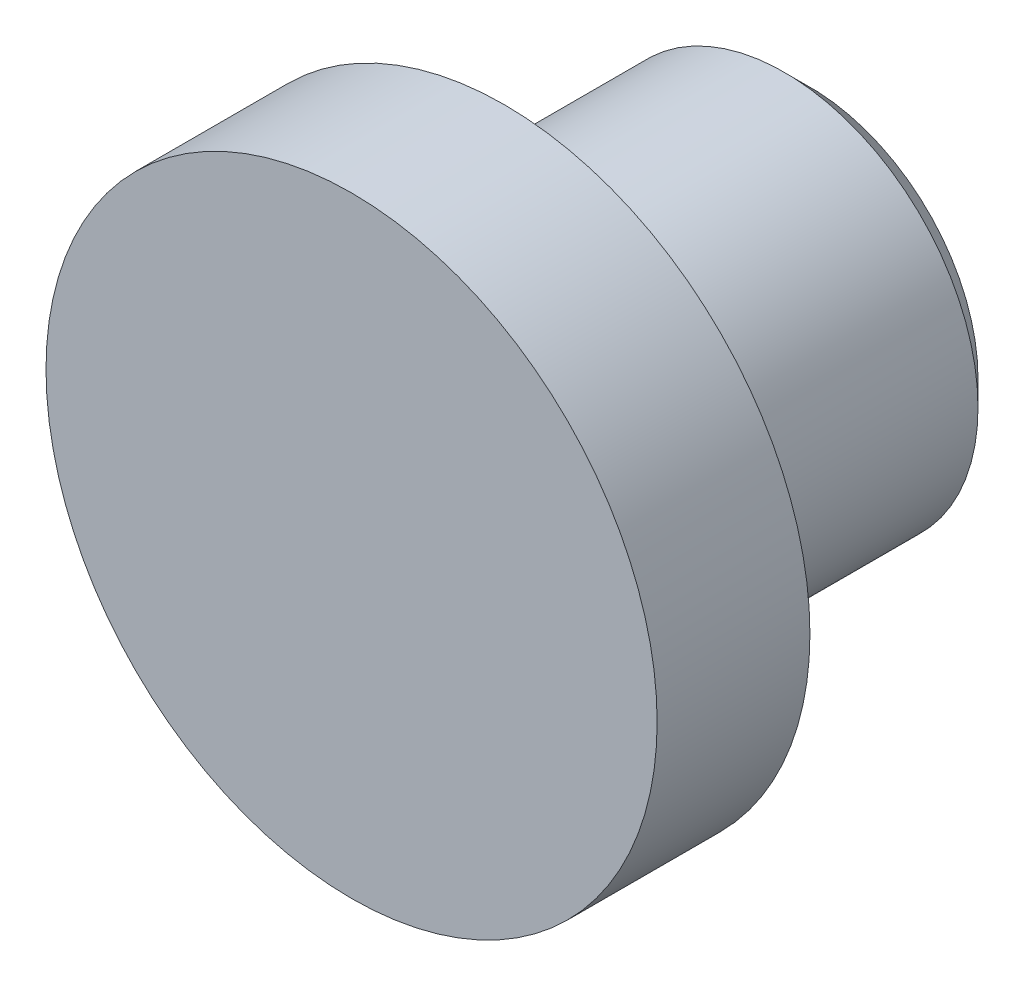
from build123d import *

# Parameters (mm, degrees)
ESQUISSE1_R        = 3.8
BOSS_EXTRU_1_DEPTH = 6
ESQUISSE2_R        = 6
BOSS_EXTRU_2_DEPTH = 3
CHANFREIN1_SIZE    = 0.5


with BuildPart() as part:
    # Esquisse1 → Boss.-Extru.1 (new body)
    with BuildSketch(Plane.XY):
        Circle(ESQUISSE1_R)
    extrude(amount=BOSS_EXTRU_1_DEPTH)

    # Esquisse2 → Boss.-Extru.2 (add)
    with BuildSketch(Plane.XY.offset(6)):
        Circle(ESQUISSE2_R)
    extrude(amount=BOSS_EXTRU_2_DEPTH)

    # Chanfrein1
    chanfrein1_edges = [part.edges().sort_by_distance(p)[0] for p in [
        (-3.8, 0, 0),
    ]]
    chamfer(chanfrein1_edges, length=CHANFREIN1_SIZE)


solid = part.part
